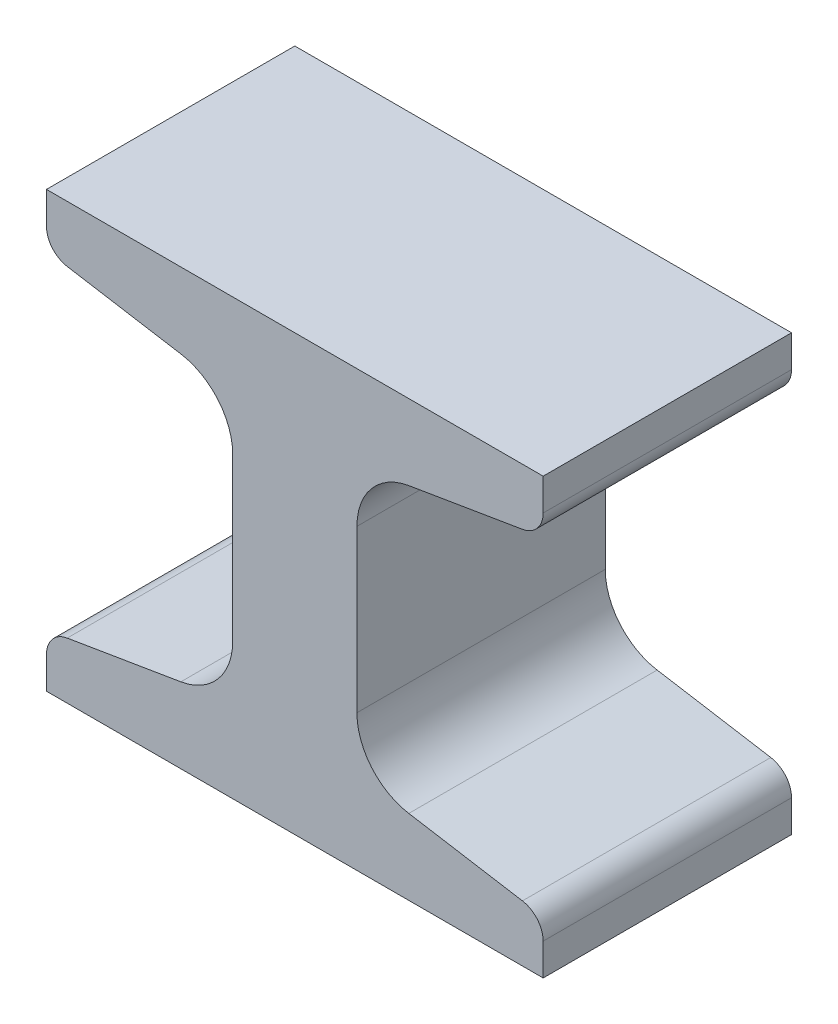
from build123d import *

# Parameters (mm, degrees)
BASEALUMBEAM_DEPTH = 12.7


with BuildPart() as part:
    # Sketch1 → BaseAlumBeam (new, symmetric)
    with BuildSketch(Plane.XY):
        with BuildLine():
            Line((0, 0), (0, 3.264524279))
            ThreePointArc((0, 3.264524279), (0.601962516, 4.90635579), (2.122528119, 5.769981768))
            Line((2.122528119, 5.769981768), (13.743679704, 7.706356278))
            ThreePointArc((13.743679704, 7.706356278), (17.54509371, 9.865421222), (19.05, 13.97))
            Line((19.05, 13.97), (19.05, 30.48))
            ThreePointArc((19.05, 30.48), (17.54509371, 34.584578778), (13.743679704, 36.743643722))
            Line((13.743679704, 36.743643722), (2.122528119, 38.680018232))
            ThreePointArc((2.122528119, 38.680018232), (0.601962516, 39.54364421), (0, 41.185475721))
            Line((0, 41.185475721), (0, 44.45))
            Line((0, 44.45), (50.8, 44.45))
            Line((50.8, 44.45), (50.8, 41.185475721))
            ThreePointArc((50.8, 41.185475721), (50.198037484, 39.54364421), (48.677471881, 38.680018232))
            Line((48.677471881, 38.680018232), (37.056320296, 36.743643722))
            ThreePointArc((37.056320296, 36.743643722), (33.25490629, 34.584578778), (31.75, 30.48))
            Line((31.75, 30.48), (31.75, 13.97))
            ThreePointArc((31.75, 13.97), (33.25490629, 9.865421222), (37.056320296, 7.706356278))
            Line((37.056320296, 7.706356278), (48.677471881, 5.769981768))
            ThreePointArc((48.677471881, 5.769981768), (50.198037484, 4.90635579), (50.8, 3.264524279))
            Line((50.8, 3.264524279), (50.8, 0))
            Line((50.8, 0), (0, 0))
        make_face()
    extrude(amount=BASEALUMBEAM_DEPTH, both=True)


solid = part.part
